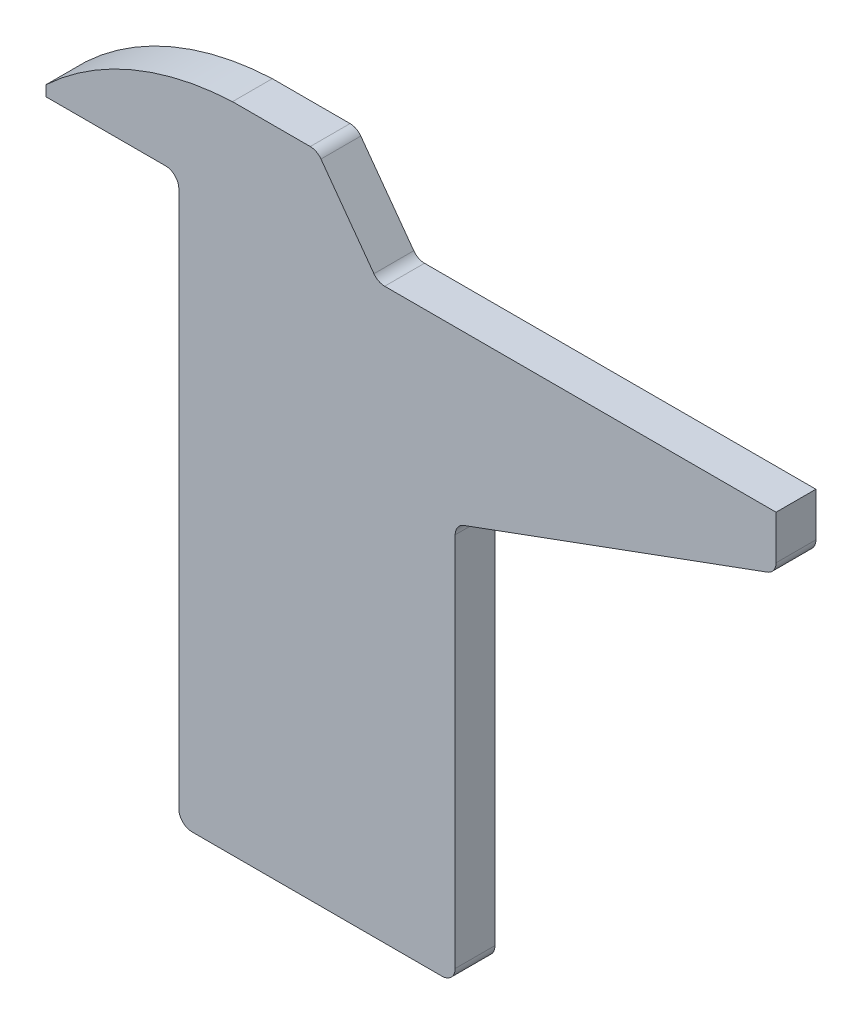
ISO-10303-21;
HEADER;
FILE_DESCRIPTION(('STEP AP214'),'2;1');
FILE_NAME('part.step','',(''),(''),'','','');
FILE_SCHEMA(('AUTOMOTIVE_DESIGN { 1 0 10303 214 1 1 1 1 }'));
ENDSEC;
DATA;
#1=APPLICATION_CONTEXT('core data for automotive mechanical design processes');
#2=APPLICATION_PROTOCOL_DEFINITION('international standard','automotive_design',2000,#1);
#3=PRODUCT_CONTEXT('',#1,'mechanical');
#4=PRODUCT('Part','Part','',(#3));
#5=PRODUCT_RELATED_PRODUCT_CATEGORY('part','',(#4));
#6=PRODUCT_DEFINITION_FORMATION('','',#4);
#7=PRODUCT_DEFINITION_CONTEXT('part definition',#1,'design');
#8=PRODUCT_DEFINITION('design','',#6,#7);
#9=PRODUCT_DEFINITION_SHAPE('','',#8);
#10=(LENGTH_UNIT() NAMED_UNIT(*) SI_UNIT(.MILLI.,.METRE.));
#11=(NAMED_UNIT(*) PLANE_ANGLE_UNIT() SI_UNIT($,.RADIAN.));
#12=(NAMED_UNIT(*) SI_UNIT($,.STERADIAN.) SOLID_ANGLE_UNIT());
#13=UNCERTAINTY_MEASURE_WITH_UNIT(LENGTH_MEASURE(1.E-05),#10,'distance_accuracy_value','');
#14=(GEOMETRIC_REPRESENTATION_CONTEXT(3) GLOBAL_UNCERTAINTY_ASSIGNED_CONTEXT((#13)) GLOBAL_UNIT_ASSIGNED_CONTEXT((#10,
#11,#12)) REPRESENTATION_CONTEXT('',''));
#15=CARTESIAN_POINT('',(0.,0.,0.));
#16=DIRECTION('',(0.,0.,1.));
#17=DIRECTION('',(1.,0.,0.));
#18=AXIS2_PLACEMENT_3D('',#15,#16,#17);
#19=CARTESIAN_POINT('',(40.,0.2,-3.));
#20=DIRECTION('',(0.,-1.,0.));
#21=DIRECTION('',(0.,0.,-1.));
#22=AXIS2_PLACEMENT_3D('',#19,#20,#21);
#23=PLANE('',#22);
#24=DIRECTION('',(1.,0.,0.));
#25=VECTOR('',#24,1.);
#26=CARTESIAN_POINT('',(40.,0.2,0.));
#27=LINE('',#26,#25);
#28=CARTESIAN_POINT('',(10.5092853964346,0.2,0.));
#29=VERTEX_POINT('',#28);
#30=CARTESIAN_POINT('',(40.,0.2,0.));
#31=VERTEX_POINT('',#30);
#32=EDGE_CURVE('E189',#29,#31,#27,.T.);
#33=ORIENTED_EDGE('',*,*,#32,.T.);
#34=DIRECTION('',(0.,0.,1.));
#35=VECTOR('',#34,1.);
#36=CARTESIAN_POINT('',(40.,0.2,-3.));
#37=LINE('',#36,#35);
#38=CARTESIAN_POINT('',(40.,0.2,-3.));
#39=VERTEX_POINT('',#38);
#40=EDGE_CURVE('E11',#39,#31,#37,.T.);
#41=ORIENTED_EDGE('',*,*,#40,.F.);
#42=DIRECTION('',(1.,0.,0.));
#43=VECTOR('',#42,1.);
#44=CARTESIAN_POINT('',(40.,0.2,-3.));
#45=LINE('',#44,#43);
#46=CARTESIAN_POINT('',(10.5092853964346,0.2,-3.));
#47=VERTEX_POINT('',#46);
#48=EDGE_CURVE('E223',#47,#39,#45,.T.);
#49=ORIENTED_EDGE('',*,*,#48,.F.);
#50=DIRECTION('',(0.,0.,1.));
#51=VECTOR('',#50,1.);
#52=CARTESIAN_POINT('',(10.5092853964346,0.2,-3.));
#53=LINE('',#52,#51);
#54=EDGE_CURVE('E185',#47,#29,#53,.T.);
#55=ORIENTED_EDGE('',*,*,#54,.T.);
#56=EDGE_LOOP('',(#33,#41,#49,#55));
#57=FACE_BOUND('',#56,.T.);
#58=ADVANCED_FACE('F33',(#57),#23,.F.);
#59=CARTESIAN_POINT('',(40.,0.2,-3.));
#60=DIRECTION('',(-1.,0.,0.));
#61=DIRECTION('',(0.,0.,1.));
#62=AXIS2_PLACEMENT_3D('',#59,#60,#61);
#63=PLANE('',#62);
#64=DIRECTION('',(0.,-1.,0.));
#65=VECTOR('',#64,1.);
#66=CARTESIAN_POINT('',(40.,0.2,0.));
#67=LINE('',#66,#65);
#68=CARTESIAN_POINT('',(40.,-3.10156364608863,0.));
#69=VERTEX_POINT('',#68);
#70=EDGE_CURVE('E192',#31,#69,#67,.T.);
#71=ORIENTED_EDGE('',*,*,#70,.T.);
#72=DIRECTION('',(0.,0.,1.));
#73=VECTOR('',#72,1.);
#74=CARTESIAN_POINT('',(40.,-3.10156364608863,-3.));
#75=LINE('',#74,#73);
#76=CARTESIAN_POINT('',(40.,-3.10156364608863,-3.));
#77=VERTEX_POINT('',#76);
#78=EDGE_CURVE('E41',#77,#69,#75,.T.);
#79=ORIENTED_EDGE('',*,*,#78,.F.);
#80=DIRECTION('',(0.,-1.,0.));
#81=VECTOR('',#80,1.);
#82=CARTESIAN_POINT('',(40.,0.2,-3.));
#83=LINE('',#82,#81);
#84=EDGE_CURVE('E122',#39,#77,#83,.T.);
#85=ORIENTED_EDGE('',*,*,#84,.F.);
#86=ORIENTED_EDGE('',*,*,#40,.T.);
#87=EDGE_LOOP('',(#71,#79,#85,#86));
#88=FACE_BOUND('',#87,.T.);
#89=ADVANCED_FACE('F331',(#88),#63,.F.);
#90=CARTESIAN_POINT('',(39.,-3.10156364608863,-3.));
#91=DIRECTION('',(0.,0.,1.));
#92=DIRECTION('',(1.,0.,0.));
#93=AXIS2_PLACEMENT_3D('',#90,#91,#92);
#94=CYLINDRICAL_SURFACE('',#93,1.);
#95=CARTESIAN_POINT('',(39.,-3.10156364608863,0.));
#96=DIRECTION('',(0.,0.,-1.));
#97=DIRECTION('',(-1.,0.,0.));
#98=AXIS2_PLACEMENT_3D('',#95,#96,#97);
#99=CIRCLE('',#98,1.);
#100=CARTESIAN_POINT('',(39.3442546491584,-4.04043996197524,0.));
#101=VERTEX_POINT('',#100);
#102=EDGE_CURVE('E194',#69,#101,#99,.T.);
#103=ORIENTED_EDGE('',*,*,#102,.T.);
#104=DIRECTION('',(0.,0.,1.));
#105=VECTOR('',#104,1.);
#106=CARTESIAN_POINT('',(39.3442546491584,-4.04043996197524,-3.));
#107=LINE('',#106,#105);
#108=CARTESIAN_POINT('',(39.3442546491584,-4.04043996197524,-3.));
#109=VERTEX_POINT('',#108);
#110=EDGE_CURVE('E260',#109,#101,#107,.T.);
#111=ORIENTED_EDGE('',*,*,#110,.F.);
#112=CARTESIAN_POINT('',(39.,-3.10156364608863,-3.));
#113=DIRECTION('',(0.,0.,-1.));
#114=DIRECTION('',(-1.,0.,0.));
#115=AXIS2_PLACEMENT_3D('',#112,#113,#114);
#116=CIRCLE('',#115,1.);
#117=EDGE_CURVE('E268',#77,#109,#116,.T.);
#118=ORIENTED_EDGE('',*,*,#117,.F.);
#119=ORIENTED_EDGE('',*,*,#78,.T.);
#120=EDGE_LOOP('',(#103,#111,#118,#119));
#121=FACE_BOUND('',#120,.T.);
#122=ADVANCED_FACE('F266',(#121),#94,.T.);
#123=CARTESIAN_POINT('',(39.3442546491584,-4.04043996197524,-3.));
#124=DIRECTION('',(-0.344254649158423,0.938876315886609,0.));
#125=DIRECTION('',(-0.938876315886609,-0.344254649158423,0.));
#126=AXIS2_PLACEMENT_3D('',#123,#124,#125);
#127=PLANE('',#126);
#128=DIRECTION('',(-0.938876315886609,-0.344254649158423,0.));
#129=VECTOR('',#128,1.);
#130=CARTESIAN_POINT('',(39.3442546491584,-4.04043996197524,0.));
#131=LINE('',#130,#129);
#132=CARTESIAN_POINT('',(16.478191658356,-12.4246630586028,0.));
#133=VERTEX_POINT('',#132);
#134=EDGE_CURVE('E196',#101,#133,#131,.T.);
#135=ORIENTED_EDGE('',*,*,#134,.T.);
#136=DIRECTION('',(0.,0.,1.));
#137=VECTOR('',#136,1.);
#138=CARTESIAN_POINT('',(16.478191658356,-12.4246630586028,-3.));
#139=LINE('',#138,#137);
#140=CARTESIAN_POINT('',(16.478191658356,-12.4246630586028,-3.));
#141=VERTEX_POINT('',#140);
#142=EDGE_CURVE('E257',#141,#133,#139,.T.);
#143=ORIENTED_EDGE('',*,*,#142,.F.);
#144=DIRECTION('',(-0.938876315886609,-0.344254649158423,0.));
#145=VECTOR('',#144,1.);
#146=CARTESIAN_POINT('',(39.3442546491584,-4.04043996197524,-3.));
#147=LINE('',#146,#145);
#148=EDGE_CURVE('E286',#109,#141,#147,.T.);
#149=ORIENTED_EDGE('',*,*,#148,.F.);
#150=ORIENTED_EDGE('',*,*,#110,.T.);
#151=EDGE_LOOP('',(#135,#143,#149,#150));
#152=FACE_BOUND('',#151,.T.);
#153=ADVANCED_FACE('F277',(#152),#127,.F.);
#154=CARTESIAN_POINT('',(16.8224463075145,-13.3635393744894,-3.));
#155=DIRECTION('',(0.,0.,1.));
#156=DIRECTION('',(1.,0.,0.));
#157=AXIS2_PLACEMENT_3D('',#154,#155,#156);
#158=CYLINDRICAL_SURFACE('',#157,1.);
#159=CARTESIAN_POINT('',(16.8224463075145,-13.3635393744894,0.));
#160=DIRECTION('',(0.,0.,1.));
#161=DIRECTION('',(1.,0.,0.));
#162=AXIS2_PLACEMENT_3D('',#159,#160,#161);
#163=CIRCLE('',#162,1.);
#164=CARTESIAN_POINT('',(15.8224463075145,-13.3635393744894,0.));
#165=VERTEX_POINT('',#164);
#166=EDGE_CURVE('E198',#133,#165,#163,.T.);
#167=ORIENTED_EDGE('',*,*,#166,.T.);
#168=DIRECTION('',(0.,0.,1.));
#169=VECTOR('',#168,1.);
#170=CARTESIAN_POINT('',(15.8224463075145,-13.3635393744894,-3.));
#171=LINE('',#170,#169);
#172=CARTESIAN_POINT('',(15.8224463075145,-13.3635393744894,-3.));
#173=VERTEX_POINT('',#172);
#174=EDGE_CURVE('E254',#173,#165,#171,.T.);
#175=ORIENTED_EDGE('',*,*,#174,.F.);
#176=CARTESIAN_POINT('',(16.8224463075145,-13.3635393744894,-3.));
#177=DIRECTION('',(0.,0.,1.));
#178=DIRECTION('',(1.,0.,0.));
#179=AXIS2_PLACEMENT_3D('',#176,#177,#178);
#180=CIRCLE('',#179,1.);
#181=EDGE_CURVE('E283',#141,#173,#180,.T.);
#182=ORIENTED_EDGE('',*,*,#181,.F.);
#183=ORIENTED_EDGE('',*,*,#142,.T.);
#184=EDGE_LOOP('',(#167,#175,#182,#183));
#185=FACE_BOUND('',#184,.T.);
#186=ADVANCED_FACE('F281',(#185),#158,.F.);
#187=CARTESIAN_POINT('',(15.8224463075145,-13.3635393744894,-3.));
#188=DIRECTION('',(-1.,0.,0.));
#189=DIRECTION('',(0.,-1.,0.));
#190=AXIS2_PLACEMENT_3D('',#187,#188,#189);
#191=PLANE('',#190);
#192=DIRECTION('',(0.,-1.,0.));
#193=VECTOR('',#192,1.);
#194=CARTESIAN_POINT('',(15.8224463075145,-13.3635393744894,0.));
#195=LINE('',#194,#193);
#196=CARTESIAN_POINT('',(15.8224463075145,-41.665103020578,0.));
#197=VERTEX_POINT('',#196);
#198=EDGE_CURVE('E200',#165,#197,#195,.T.);
#199=ORIENTED_EDGE('',*,*,#198,.T.);
#200=DIRECTION('',(0.,0.,1.));
#201=VECTOR('',#200,1.);
#202=CARTESIAN_POINT('',(15.8224463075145,-41.665103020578,-3.));
#203=LINE('',#202,#201);
#204=CARTESIAN_POINT('',(15.8224463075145,-41.665103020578,-3.));
#205=VERTEX_POINT('',#204);
#206=EDGE_CURVE('E251',#205,#197,#203,.T.);
#207=ORIENTED_EDGE('',*,*,#206,.F.);
#208=DIRECTION('',(0.,-1.,0.));
#209=VECTOR('',#208,1.);
#210=CARTESIAN_POINT('',(15.8224463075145,-13.3635393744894,-3.));
#211=LINE('',#210,#209);
#212=EDGE_CURVE('E285',#173,#205,#211,.T.);
#213=ORIENTED_EDGE('',*,*,#212,.F.);
#214=ORIENTED_EDGE('',*,*,#174,.T.);
#215=EDGE_LOOP('',(#199,#207,#213,#214));
#216=FACE_BOUND('',#215,.T.);
#217=ADVANCED_FACE('F344',(#216),#191,.F.);
#218=CARTESIAN_POINT('',(14.8224463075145,-41.665103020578,-3.));
#219=DIRECTION('',(0.,0.,1.));
#220=DIRECTION('',(1.,0.,0.));
#221=AXIS2_PLACEMENT_3D('',#218,#219,#220);
#222=CYLINDRICAL_SURFACE('',#221,1.);
#223=CARTESIAN_POINT('',(14.8224463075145,-41.665103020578,0.));
#224=DIRECTION('',(0.,0.,-1.));
#225=DIRECTION('',(-1.,0.,0.));
#226=AXIS2_PLACEMENT_3D('',#223,#224,#225);
#227=CIRCLE('',#226,1.);
#228=CARTESIAN_POINT('',(14.8224463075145,-42.665103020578,0.));
#229=VERTEX_POINT('',#228);
#230=EDGE_CURVE('E202',#197,#229,#227,.T.);
#231=ORIENTED_EDGE('',*,*,#230,.T.);
#232=DIRECTION('',(0.,0.,1.));
#233=VECTOR('',#232,1.);
#234=CARTESIAN_POINT('',(14.8224463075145,-42.665103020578,-3.));
#235=LINE('',#234,#233);
#236=CARTESIAN_POINT('',(14.8224463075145,-42.665103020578,-3.));
#237=VERTEX_POINT('',#236);
#238=EDGE_CURVE('E248',#237,#229,#235,.T.);
#239=ORIENTED_EDGE('',*,*,#238,.F.);
#240=CARTESIAN_POINT('',(14.8224463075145,-41.665103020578,-3.));
#241=DIRECTION('',(0.,0.,-1.));
#242=DIRECTION('',(-1.,0.,0.));
#243=AXIS2_PLACEMENT_3D('',#240,#241,#242);
#244=CIRCLE('',#243,1.);
#245=EDGE_CURVE('E288',#205,#237,#244,.T.);
#246=ORIENTED_EDGE('',*,*,#245,.F.);
#247=ORIENTED_EDGE('',*,*,#206,.T.);
#248=EDGE_LOOP('',(#231,#239,#246,#247));
#249=FACE_BOUND('',#248,.T.);
#250=ADVANCED_FACE('F347',(#249),#222,.T.);
#251=CARTESIAN_POINT('',(14.8224463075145,-42.665103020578,-3.));
#252=DIRECTION('',(0.,1.,0.));
#253=DIRECTION('',(0.,0.,1.));
#254=AXIS2_PLACEMENT_3D('',#251,#252,#253);
#255=PLANE('',#254);
#256=DIRECTION('',(-1.,0.,0.));
#257=VECTOR('',#256,1.);
#258=CARTESIAN_POINT('',(14.8224463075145,-42.665103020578,0.));
#259=LINE('',#258,#257);
#260=CARTESIAN_POINT('',(-4.,-42.665103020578,0.));
#261=VERTEX_POINT('',#260);
#262=EDGE_CURVE('E204',#229,#261,#259,.T.);
#263=ORIENTED_EDGE('',*,*,#262,.T.);
#264=DIRECTION('',(0.,0.,1.));
#265=VECTOR('',#264,1.);
#266=CARTESIAN_POINT('',(-4.,-42.665103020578,-3.));
#267=LINE('',#266,#265);
#268=CARTESIAN_POINT('',(-4.,-42.665103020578,-3.));
#269=VERTEX_POINT('',#268);
#270=EDGE_CURVE('E245',#269,#261,#267,.T.);
#271=ORIENTED_EDGE('',*,*,#270,.F.);
#272=DIRECTION('',(-1.,0.,0.));
#273=VECTOR('',#272,1.);
#274=CARTESIAN_POINT('',(14.8224463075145,-42.665103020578,-3.));
#275=LINE('',#274,#273);
#276=EDGE_CURVE('E294',#237,#269,#275,.T.);
#277=ORIENTED_EDGE('',*,*,#276,.F.);
#278=ORIENTED_EDGE('',*,*,#238,.T.);
#279=EDGE_LOOP('',(#263,#271,#277,#278));
#280=FACE_BOUND('',#279,.T.);
#281=ADVANCED_FACE('F351',(#280),#255,.F.);
#282=CARTESIAN_POINT('',(-4.,-41.665103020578,-3.));
#283=DIRECTION('',(0.,0.,1.));
#284=DIRECTION('',(1.,0.,0.));
#285=AXIS2_PLACEMENT_3D('',#282,#283,#284);
#286=CYLINDRICAL_SURFACE('',#285,1.);
#287=CARTESIAN_POINT('',(-4.,-41.665103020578,0.));
#288=DIRECTION('',(0.,0.,-1.));
#289=DIRECTION('',(-1.,0.,0.));
#290=AXIS2_PLACEMENT_3D('',#287,#288,#289);
#291=CIRCLE('',#290,1.);
#292=CARTESIAN_POINT('',(-5.,-41.665103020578,0.));
#293=VERTEX_POINT('',#292);
#294=EDGE_CURVE('E206',#261,#293,#291,.T.);
#295=ORIENTED_EDGE('',*,*,#294,.T.);
#296=DIRECTION('',(0.,0.,1.));
#297=VECTOR('',#296,1.);
#298=CARTESIAN_POINT('',(-5.,-41.665103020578,-3.));
#299=LINE('',#298,#297);
#300=CARTESIAN_POINT('',(-5.,-41.665103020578,-3.));
#301=VERTEX_POINT('',#300);
#302=EDGE_CURVE('E242',#301,#293,#299,.T.);
#303=ORIENTED_EDGE('',*,*,#302,.F.);
#304=CARTESIAN_POINT('',(-4.,-41.665103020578,-3.));
#305=DIRECTION('',(0.,0.,-1.));
#306=DIRECTION('',(-1.,0.,0.));
#307=AXIS2_PLACEMENT_3D('',#304,#305,#306);
#308=CIRCLE('',#307,1.);
#309=EDGE_CURVE('E296',#269,#301,#308,.T.);
#310=ORIENTED_EDGE('',*,*,#309,.F.);
#311=ORIENTED_EDGE('',*,*,#270,.T.);
#312=EDGE_LOOP('',(#295,#303,#310,#311));
#313=FACE_BOUND('',#312,.T.);
#314=ADVANCED_FACE('F355',(#313),#286,.T.);
#315=CARTESIAN_POINT('',(-5.,-1.2,-3.));
#316=DIRECTION('',(1.,0.,0.));
#317=DIRECTION('',(0.,1.,0.));
#318=AXIS2_PLACEMENT_3D('',#315,#316,#317);
#319=PLANE('',#318);
#320=DIRECTION('',(0.,1.,0.));
#321=VECTOR('',#320,1.);
#322=CARTESIAN_POINT('',(-5.,-1.2,0.));
#323=LINE('',#322,#321);
#324=CARTESIAN_POINT('',(-5.,-1.2,0.));
#325=VERTEX_POINT('',#324);
#326=EDGE_CURVE('E208',#293,#325,#323,.T.);
#327=ORIENTED_EDGE('',*,*,#326,.T.);
#328=DIRECTION('',(0.,0.,1.));
#329=VECTOR('',#328,1.);
#330=CARTESIAN_POINT('',(-5.,-1.2,-3.));
#331=LINE('',#330,#329);
#332=CARTESIAN_POINT('',(-5.,-1.2,-3.));
#333=VERTEX_POINT('',#332);
#334=EDGE_CURVE('E239',#333,#325,#331,.T.);
#335=ORIENTED_EDGE('',*,*,#334,.F.);
#336=DIRECTION('',(0.,1.,0.));
#337=VECTOR('',#336,1.);
#338=CARTESIAN_POINT('',(-5.,-1.2,-3.));
#339=LINE('',#338,#337);
#340=EDGE_CURVE('E298',#301,#333,#339,.T.);
#341=ORIENTED_EDGE('',*,*,#340,.F.);
#342=ORIENTED_EDGE('',*,*,#302,.T.);
#343=EDGE_LOOP('',(#327,#335,#341,#342));
#344=FACE_BOUND('',#343,.T.);
#345=ADVANCED_FACE('F359',(#344),#319,.F.);
#346=CARTESIAN_POINT('',(-6.,-1.2,-3.));
#347=DIRECTION('',(0.,0.,1.));
#348=DIRECTION('',(1.,0.,0.));
#349=AXIS2_PLACEMENT_3D('',#346,#347,#348);
#350=CYLINDRICAL_SURFACE('',#349,1.);
#351=CARTESIAN_POINT('',(-6.,-1.2,0.));
#352=DIRECTION('',(0.,0.,1.));
#353=DIRECTION('',(-1.,0.,0.));
#354=AXIS2_PLACEMENT_3D('',#351,#352,#353);
#355=CIRCLE('',#354,1.);
#356=CARTESIAN_POINT('',(-6.,-0.200000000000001,0.));
#357=VERTEX_POINT('',#356);
#358=EDGE_CURVE('E210',#325,#357,#355,.T.);
#359=ORIENTED_EDGE('',*,*,#358,.T.);
#360=DIRECTION('',(0.,0.,1.));
#361=VECTOR('',#360,1.);
#362=CARTESIAN_POINT('',(-6.,-0.200000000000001,-3.));
#363=LINE('',#362,#361);
#364=CARTESIAN_POINT('',(-6.,-0.200000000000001,-3.));
#365=VERTEX_POINT('',#364);
#366=EDGE_CURVE('E236',#365,#357,#363,.T.);
#367=ORIENTED_EDGE('',*,*,#366,.F.);
#368=CARTESIAN_POINT('',(-6.,-1.2,-3.));
#369=DIRECTION('',(0.,0.,1.));
#370=DIRECTION('',(-1.,0.,0.));
#371=AXIS2_PLACEMENT_3D('',#368,#369,#370);
#372=CIRCLE('',#371,1.);
#373=EDGE_CURVE('E300',#333,#365,#372,.T.);
#374=ORIENTED_EDGE('',*,*,#373,.F.);
#375=ORIENTED_EDGE('',*,*,#334,.T.);
#376=EDGE_LOOP('',(#359,#367,#374,#375));
#377=FACE_BOUND('',#376,.T.);
#378=ADVANCED_FACE('F363',(#377),#350,.F.);
#379=CARTESIAN_POINT('',(-15.,-0.2,-3.));
#380=DIRECTION('',(0.,1.,0.));
#381=DIRECTION('',(-1.,0.,0.));
#382=AXIS2_PLACEMENT_3D('',#379,#380,#381);
#383=PLANE('',#382);
#384=DIRECTION('',(-1.,0.,0.));
#385=VECTOR('',#384,1.);
#386=CARTESIAN_POINT('',(-15.,-0.2,0.));
#387=LINE('',#386,#385);
#388=CARTESIAN_POINT('',(-15.,-0.2,0.));
#389=VERTEX_POINT('',#388);
#390=EDGE_CURVE('E212',#357,#389,#387,.T.);
#391=ORIENTED_EDGE('',*,*,#390,.T.);
#392=DIRECTION('',(0.,0.,1.));
#393=VECTOR('',#392,1.);
#394=CARTESIAN_POINT('',(-15.,-0.2,-3.));
#395=LINE('',#394,#393);
#396=CARTESIAN_POINT('',(-15.,-0.2,-3.));
#397=VERTEX_POINT('',#396);
#398=EDGE_CURVE('E233',#397,#389,#395,.T.);
#399=ORIENTED_EDGE('',*,*,#398,.F.);
#400=DIRECTION('',(-1.,0.,0.));
#401=VECTOR('',#400,1.);
#402=CARTESIAN_POINT('',(-15.,-0.2,-3.));
#403=LINE('',#402,#401);
#404=EDGE_CURVE('E302',#365,#397,#403,.T.);
#405=ORIENTED_EDGE('',*,*,#404,.F.);
#406=ORIENTED_EDGE('',*,*,#366,.T.);
#407=EDGE_LOOP('',(#391,#399,#405,#406));
#408=FACE_BOUND('',#407,.T.);
#409=ADVANCED_FACE('F367',(#408),#383,.F.);
#410=CARTESIAN_POINT('',(-15.,-0.2,-3.));
#411=DIRECTION('',(1.,0.,0.));
#412=DIRECTION('',(0.,1.,0.));
#413=AXIS2_PLACEMENT_3D('',#410,#411,#412);
#414=PLANE('',#413);
#415=DIRECTION('',(0.,1.,0.));
#416=VECTOR('',#415,1.);
#417=CARTESIAN_POINT('',(-15.,-0.2,0.));
#418=LINE('',#417,#416);
#419=CARTESIAN_POINT('',(-15.,0.599999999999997,0.));
#420=VERTEX_POINT('',#419);
#421=EDGE_CURVE('E214',#389,#420,#418,.T.);
#422=ORIENTED_EDGE('',*,*,#421,.T.);
#423=DIRECTION('',(0.,0.,1.));
#424=VECTOR('',#423,1.);
#425=CARTESIAN_POINT('',(-15.,0.599999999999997,-3.));
#426=LINE('',#425,#424);
#427=CARTESIAN_POINT('',(-15.,0.599999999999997,-3.));
#428=VERTEX_POINT('',#427);
#429=EDGE_CURVE('E230',#428,#420,#426,.T.);
#430=ORIENTED_EDGE('',*,*,#429,.F.);
#431=DIRECTION('',(0.,1.,0.));
#432=VECTOR('',#431,1.);
#433=CARTESIAN_POINT('',(-15.,-0.2,-3.));
#434=LINE('',#433,#432);
#435=EDGE_CURVE('E304',#397,#428,#434,.T.);
#436=ORIENTED_EDGE('',*,*,#435,.F.);
#437=ORIENTED_EDGE('',*,*,#398,.T.);
#438=EDGE_LOOP('',(#422,#430,#436,#437));
#439=FACE_BOUND('',#438,.T.);
#440=ADVANCED_FACE('F371',(#439),#414,.F.);
#441=CARTESIAN_POINT('',(0.,-15.4,-3.));
#442=DIRECTION('',(0.,0.,1.));
#443=DIRECTION('',(1.,0.,0.));
#444=AXIS2_PLACEMENT_3D('',#441,#442,#443);
#445=CYLINDRICAL_SURFACE('',#444,21.9317121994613);
#446=CARTESIAN_POINT('',(0.,-15.4,0.));
#447=DIRECTION('',(0.,0.,-1.));
#448=DIRECTION('',(1.,0.,0.));
#449=AXIS2_PLACEMENT_3D('',#446,#447,#448);
#450=CIRCLE('',#449,21.9317121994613);
#451=CARTESIAN_POINT('',(-0.956392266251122,6.51084922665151,0.));
#452=VERTEX_POINT('',#451);
#453=EDGE_CURVE('E216',#420,#452,#450,.T.);
#454=ORIENTED_EDGE('',*,*,#453,.T.);
#455=DIRECTION('',(0.,0.,1.));
#456=VECTOR('',#455,1.);
#457=CARTESIAN_POINT('',(-0.956392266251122,6.51084922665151,-3.));
#458=LINE('',#457,#456);
#459=CARTESIAN_POINT('',(-0.956392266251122,6.51084922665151,-3.));
#460=VERTEX_POINT('',#459);
#461=EDGE_CURVE('E227',#460,#452,#458,.T.);
#462=ORIENTED_EDGE('',*,*,#461,.F.);
#463=CARTESIAN_POINT('',(0.,-15.4,-3.));
#464=DIRECTION('',(0.,0.,-1.));
#465=DIRECTION('',(1.,0.,0.));
#466=AXIS2_PLACEMENT_3D('',#463,#464,#465);
#467=CIRCLE('',#466,21.9317121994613);
#468=EDGE_CURVE('E306',#428,#460,#467,.T.);
#469=ORIENTED_EDGE('',*,*,#468,.F.);
#470=ORIENTED_EDGE('',*,*,#429,.T.);
#471=EDGE_LOOP('',(#454,#462,#469,#470));
#472=FACE_BOUND('',#471,.T.);
#473=ADVANCED_FACE('F312',(#472),#445,.T.);
#474=CARTESIAN_POINT('',(4.90193775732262,6.51084922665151,-3.));
#475=DIRECTION('',(0.,-1.,0.));
#476=DIRECTION('',(0.,0.,-1.));
#477=AXIS2_PLACEMENT_3D('',#474,#475,#476);
#478=PLANE('',#477);
#479=DIRECTION('',(1.,0.,0.));
#480=VECTOR('',#479,1.);
#481=CARTESIAN_POINT('',(4.90193775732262,6.51084922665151,0.));
#482=LINE('',#481,#480);
#483=CARTESIAN_POINT('',(4.90193775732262,6.51084922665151,0.));
#484=VERTEX_POINT('',#483);
#485=EDGE_CURVE('E218',#452,#484,#482,.T.);
#486=ORIENTED_EDGE('',*,*,#485,.T.);
#487=DIRECTION('',(0.,0.,1.));
#488=VECTOR('',#487,1.);
#489=CARTESIAN_POINT('',(4.90193775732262,6.51084922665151,-3.));
#490=LINE('',#489,#488);
#491=CARTESIAN_POINT('',(4.90193775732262,6.51084922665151,-3.));
#492=VERTEX_POINT('',#491);
#493=EDGE_CURVE('E180',#492,#484,#490,.T.);
#494=ORIENTED_EDGE('',*,*,#493,.F.);
#495=DIRECTION('',(1.,0.,0.));
#496=VECTOR('',#495,1.);
#497=CARTESIAN_POINT('',(4.90193775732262,6.51084922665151,-3.));
#498=LINE('',#497,#496);
#499=EDGE_CURVE('E171',#460,#492,#498,.T.);
#500=ORIENTED_EDGE('',*,*,#499,.F.);
#501=ORIENTED_EDGE('',*,*,#461,.T.);
#502=EDGE_LOOP('',(#486,#494,#500,#501));
#503=FACE_BOUND('',#502,.T.);
#504=ADVANCED_FACE('F316',(#503),#478,.F.);
#505=CARTESIAN_POINT('',(4.90193775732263,5.51084922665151,-3.));
#506=DIRECTION('',(0.,0.,1.));
#507=DIRECTION('',(1.,0.,0.));
#508=AXIS2_PLACEMENT_3D('',#505,#506,#507);
#509=CYLINDRICAL_SURFACE('',#508,1.);
#510=CARTESIAN_POINT('',(4.90193775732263,5.51084922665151,0.));
#511=DIRECTION('',(0.,0.,-1.));
#512=DIRECTION('',(-1.,0.,0.));
#513=AXIS2_PLACEMENT_3D('',#510,#511,#512);
#514=CIRCLE('',#513,1.);
#515=CARTESIAN_POINT('',(5.71073063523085,6.09894282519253,0.));
#516=VERTEX_POINT('',#515);
#517=EDGE_CURVE('E179',#484,#516,#514,.T.);
#518=ORIENTED_EDGE('',*,*,#517,.T.);
#519=DIRECTION('',(0.,0.,1.));
#520=VECTOR('',#519,1.);
#521=CARTESIAN_POINT('',(5.71073063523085,6.09894282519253,-3.));
#522=LINE('',#521,#520);
#523=CARTESIAN_POINT('',(5.71073063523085,6.09894282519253,-3.));
#524=VERTEX_POINT('',#523);
#525=EDGE_CURVE('E176',#524,#516,#522,.T.);
#526=ORIENTED_EDGE('',*,*,#525,.F.);
#527=CARTESIAN_POINT('',(4.90193775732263,5.51084922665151,-3.));
#528=DIRECTION('',(0.,0.,-1.));
#529=DIRECTION('',(-1.,0.,0.));
#530=AXIS2_PLACEMENT_3D('',#527,#528,#529);
#531=CIRCLE('',#530,1.);
#532=EDGE_CURVE('E165',#492,#524,#531,.T.);
#533=ORIENTED_EDGE('',*,*,#532,.F.);
#534=ORIENTED_EDGE('',*,*,#493,.T.);
#535=EDGE_LOOP('',(#518,#526,#533,#534));
#536=FACE_BOUND('',#535,.T.);
#537=ADVANCED_FACE('F177',(#536),#509,.T.);
#538=CARTESIAN_POINT('',(9.70049251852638,0.61190640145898,-3.));
#539=DIRECTION('',(-0.808792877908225,-0.588093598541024,0.));
#540=DIRECTION('',(0.588093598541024,-0.808792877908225,0.));
#541=AXIS2_PLACEMENT_3D('',#538,#539,#540);
#542=PLANE('',#541);
#543=DIRECTION('',(0.588093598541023,-0.808792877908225,0.));
#544=VECTOR('',#543,1.);
#545=CARTESIAN_POINT('',(9.70049251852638,0.61190640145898,0.));
#546=LINE('',#545,#544);
#547=CARTESIAN_POINT('',(9.70049251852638,0.61190640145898,0.));
#548=VERTEX_POINT('',#547);
#549=EDGE_CURVE('E108',#516,#548,#546,.T.);
#550=ORIENTED_EDGE('',*,*,#549,.T.);
#551=DIRECTION('',(0.,0.,1.));
#552=VECTOR('',#551,1.);
#553=CARTESIAN_POINT('',(9.70049251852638,0.61190640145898,-3.));
#554=LINE('',#553,#552);
#555=CARTESIAN_POINT('',(9.70049251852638,0.61190640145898,-3.));
#556=VERTEX_POINT('',#555);
#557=EDGE_CURVE('E181',#556,#548,#554,.T.);
#558=ORIENTED_EDGE('',*,*,#557,.F.);
#559=DIRECTION('',(0.588093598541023,-0.808792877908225,0.));
#560=VECTOR('',#559,1.);
#561=CARTESIAN_POINT('',(9.70049251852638,0.61190640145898,-3.));
#562=LINE('',#561,#560);
#563=EDGE_CURVE('E169',#524,#556,#562,.T.);
#564=ORIENTED_EDGE('',*,*,#563,.F.);
#565=ORIENTED_EDGE('',*,*,#525,.T.);
#566=EDGE_LOOP('',(#550,#558,#564,#565));
#567=FACE_BOUND('',#566,.T.);
#568=ADVANCED_FACE('F183',(#567),#542,.F.);
#569=CARTESIAN_POINT('',(10.5092853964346,1.2,-3.));
#570=DIRECTION('',(0.,0.,1.));
#571=DIRECTION('',(1.,0.,0.));
#572=AXIS2_PLACEMENT_3D('',#569,#570,#571);
#573=CYLINDRICAL_SURFACE('',#572,1.);
#574=CARTESIAN_POINT('',(10.5092853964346,1.2,0.));
#575=DIRECTION('',(0.,0.,1.));
#576=DIRECTION('',(-1.,0.,0.));
#577=AXIS2_PLACEMENT_3D('',#574,#575,#576);
#578=CIRCLE('',#577,1.);
#579=EDGE_CURVE('E114',#548,#29,#578,.T.);
#580=ORIENTED_EDGE('',*,*,#579,.T.);
#581=ORIENTED_EDGE('',*,*,#54,.F.);
#582=CARTESIAN_POINT('',(10.5092853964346,1.2,-3.));
#583=DIRECTION('',(0.,0.,1.));
#584=DIRECTION('',(-1.,0.,0.));
#585=AXIS2_PLACEMENT_3D('',#582,#583,#584);
#586=CIRCLE('',#585,1.);
#587=EDGE_CURVE('E49',#556,#47,#586,.T.);
#588=ORIENTED_EDGE('',*,*,#587,.F.);
#589=ORIENTED_EDGE('',*,*,#557,.T.);
#590=EDGE_LOOP('',(#580,#581,#588,#589));
#591=FACE_BOUND('',#590,.T.);
#592=ADVANCED_FACE('F320',(#591),#573,.F.);
#593=CARTESIAN_POINT('',(10.5092853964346,1.2,-3.));
#594=DIRECTION('',(0.,0.,-1.));
#595=DIRECTION('',(-1.,0.,0.));
#596=AXIS2_PLACEMENT_3D('',#593,#594,#595);
#597=PLANE('',#596);
#598=ORIENTED_EDGE('',*,*,#48,.T.);
#599=ORIENTED_EDGE('',*,*,#84,.T.);
#600=ORIENTED_EDGE('',*,*,#117,.T.);
#601=ORIENTED_EDGE('',*,*,#148,.T.);
#602=ORIENTED_EDGE('',*,*,#181,.T.);
#603=ORIENTED_EDGE('',*,*,#212,.T.);
#604=ORIENTED_EDGE('',*,*,#245,.T.);
#605=ORIENTED_EDGE('',*,*,#276,.T.);
#606=ORIENTED_EDGE('',*,*,#309,.T.);
#607=ORIENTED_EDGE('',*,*,#340,.T.);
#608=ORIENTED_EDGE('',*,*,#373,.T.);
#609=ORIENTED_EDGE('',*,*,#404,.T.);
#610=ORIENTED_EDGE('',*,*,#435,.T.);
#611=ORIENTED_EDGE('',*,*,#468,.T.);
#612=ORIENTED_EDGE('',*,*,#499,.T.);
#613=ORIENTED_EDGE('',*,*,#532,.T.);
#614=ORIENTED_EDGE('',*,*,#563,.T.);
#615=ORIENTED_EDGE('',*,*,#587,.T.);
#616=EDGE_LOOP('',(#598,#599,#600,#601,#602,#603,#604,#605,#606,#607,#608,#609,#610,#611,#612,
#613,#614,#615));
#617=FACE_BOUND('',#616,.T.);
#618=ADVANCED_FACE('F167',(#617),#597,.T.);
#619=CARTESIAN_POINT('',(10.5092853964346,1.2,0.));
#620=DIRECTION('',(0.,0.,-1.));
#621=DIRECTION('',(-1.,0.,0.));
#622=AXIS2_PLACEMENT_3D('',#619,#620,#621);
#623=PLANE('',#622);
#624=ORIENTED_EDGE('',*,*,#32,.F.);
#625=ORIENTED_EDGE('',*,*,#579,.F.);
#626=ORIENTED_EDGE('',*,*,#549,.F.);
#627=ORIENTED_EDGE('',*,*,#517,.F.);
#628=ORIENTED_EDGE('',*,*,#485,.F.);
#629=ORIENTED_EDGE('',*,*,#453,.F.);
#630=ORIENTED_EDGE('',*,*,#421,.F.);
#631=ORIENTED_EDGE('',*,*,#390,.F.);
#632=ORIENTED_EDGE('',*,*,#358,.F.);
#633=ORIENTED_EDGE('',*,*,#326,.F.);
#634=ORIENTED_EDGE('',*,*,#294,.F.);
#635=ORIENTED_EDGE('',*,*,#262,.F.);
#636=ORIENTED_EDGE('',*,*,#230,.F.);
#637=ORIENTED_EDGE('',*,*,#198,.F.);
#638=ORIENTED_EDGE('',*,*,#166,.F.);
#639=ORIENTED_EDGE('',*,*,#134,.F.);
#640=ORIENTED_EDGE('',*,*,#102,.F.);
#641=ORIENTED_EDGE('',*,*,#70,.F.);
#642=EDGE_LOOP('',(#624,#625,#626,#627,#628,#629,#630,#631,#632,#633,#634,#635,#636,#637,#638,
#639,#640,#641));
#643=FACE_BOUND('',#642,.T.);
#644=ADVANCED_FACE('F272',(#643),#623,.F.);
#645=CLOSED_SHELL('',(#58,#89,#122,#153,#186,#217,#250,#281,#314,#345,#378,#409,#440,#473,#504,
#537,#568,#592,#618,#644));
#646=MANIFOLD_SOLID_BREP('B2',#645);
#647=ADVANCED_BREP_SHAPE_REPRESENTATION('',(#18,#646),#14);
#648=SHAPE_DEFINITION_REPRESENTATION(#9,#647);
ENDSEC;
END-ISO-10303-21;
